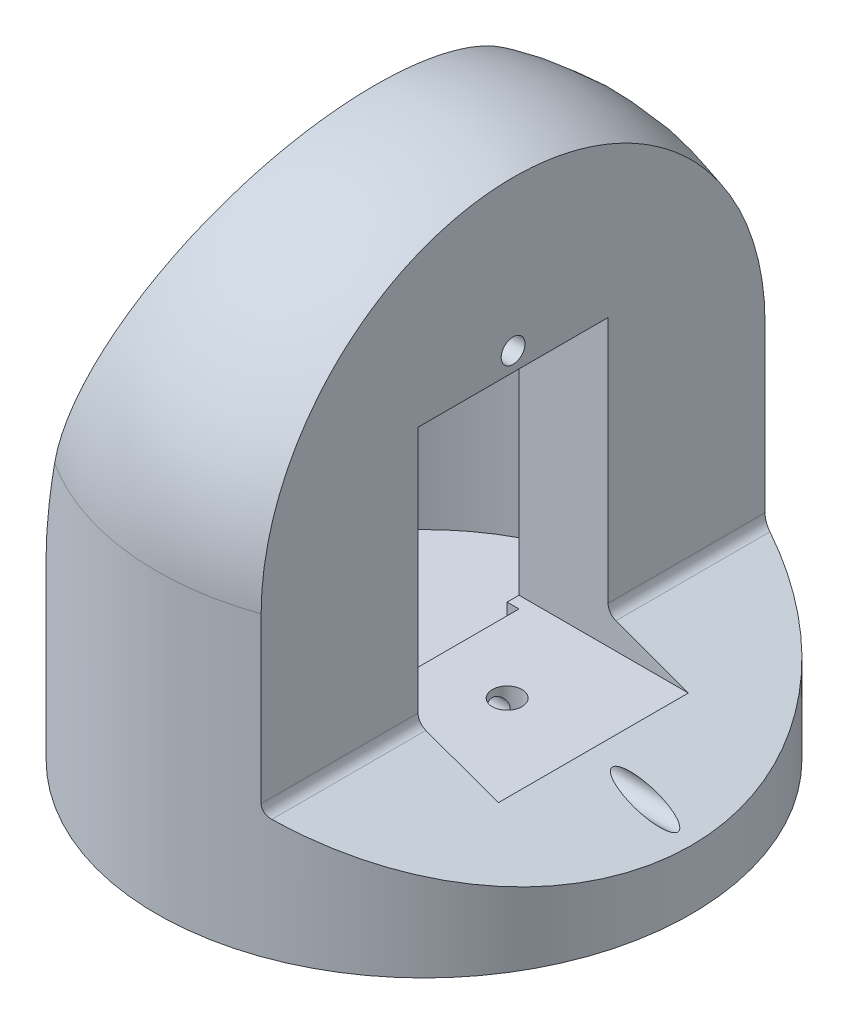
ISO-10303-21;
HEADER;
FILE_DESCRIPTION(('STEP AP214'),'2;1');
FILE_NAME('part.step','',(''),(''),'','','');
FILE_SCHEMA(('AUTOMOTIVE_DESIGN { 1 0 10303 214 1 1 1 1 }'));
ENDSEC;
DATA;
#1=APPLICATION_CONTEXT('core data for automotive mechanical design processes');
#2=APPLICATION_PROTOCOL_DEFINITION('international standard','automotive_design',2000,#1);
#3=PRODUCT_CONTEXT('',#1,'mechanical');
#4=PRODUCT('Part','Part','',(#3));
#5=PRODUCT_RELATED_PRODUCT_CATEGORY('part','',(#4));
#6=PRODUCT_DEFINITION_FORMATION('','',#4);
#7=PRODUCT_DEFINITION_CONTEXT('part definition',#1,'design');
#8=PRODUCT_DEFINITION('design','',#6,#7);
#9=PRODUCT_DEFINITION_SHAPE('','',#8);
#10=(LENGTH_UNIT() NAMED_UNIT(*) SI_UNIT(.MILLI.,.METRE.));
#11=(NAMED_UNIT(*) PLANE_ANGLE_UNIT() SI_UNIT($,.RADIAN.));
#12=(NAMED_UNIT(*) SI_UNIT($,.STERADIAN.) SOLID_ANGLE_UNIT());
#13=UNCERTAINTY_MEASURE_WITH_UNIT(LENGTH_MEASURE(1.E-05),#10,'distance_accuracy_value','');
#14=(GEOMETRIC_REPRESENTATION_CONTEXT(3) GLOBAL_UNCERTAINTY_ASSIGNED_CONTEXT((#13)) GLOBAL_UNIT_ASSIGNED_CONTEXT((#10,
#11,#12)) REPRESENTATION_CONTEXT('',''));
#15=CARTESIAN_POINT('',(0.,0.,0.));
#16=DIRECTION('',(0.,0.,1.));
#17=DIRECTION('',(1.,0.,0.));
#18=AXIS2_PLACEMENT_3D('',#15,#16,#17);
#19=CARTESIAN_POINT('',(0.,25.,0.));
#20=DIRECTION('',(-1.,0.,0.));
#21=DIRECTION('',(0.,0.,1.));
#22=AXIS2_PLACEMENT_3D('',#19,#20,#21);
#23=PLANE('',#22);
#24=DIRECTION('',(0.,0.,1.));
#25=VECTOR('',#24,1.);
#26=CARTESIAN_POINT('',(0.,37.,0.));
#27=LINE('',#26,#25);
#28=CARTESIAN_POINT('',(0.,37.,-6.99999999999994));
#29=VERTEX_POINT('',#28);
#30=CARTESIAN_POINT('',(0.,37.,6.99999999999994));
#31=VERTEX_POINT('',#30);
#32=EDGE_CURVE('E233',#29,#31,#27,.T.);
#33=ORIENTED_EDGE('',*,*,#32,.T.);
#34=DIRECTION('',(0.,-1.,0.));
#35=VECTOR('',#34,1.);
#36=CARTESIAN_POINT('',(0.,0.,6.99999999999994));
#37=LINE('',#36,#35);
#38=CARTESIAN_POINT('',(0.,32.,6.99999999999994));
#39=VERTEX_POINT('',#38);
#40=EDGE_CURVE('E223',#31,#39,#37,.T.);
#41=ORIENTED_EDGE('',*,*,#40,.T.);
#42=DIRECTION('',(0.,0.,1.));
#43=VECTOR('',#42,1.);
#44=CARTESIAN_POINT('',(0.,32.,0.));
#45=LINE('',#44,#43);
#46=CARTESIAN_POINT('',(0.,32.,8.00000000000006));
#47=VERTEX_POINT('',#46);
#48=EDGE_CURVE('E280',#39,#47,#45,.T.);
#49=ORIENTED_EDGE('',*,*,#48,.T.);
#50=DIRECTION('',(0.,1.,0.));
#51=VECTOR('',#50,1.);
#52=CARTESIAN_POINT('',(0.,0.,8.00000000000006));
#53=LINE('',#52,#51);
#54=CARTESIAN_POINT('',(0.,8.00000000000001,8.00000000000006));
#55=VERTEX_POINT('',#54);
#56=EDGE_CURVE('E277',#55,#47,#53,.T.);
#57=ORIENTED_EDGE('',*,*,#56,.F.);
#58=DIRECTION('',(0.,0.,1.));
#59=VECTOR('',#58,1.);
#60=CARTESIAN_POINT('',(0.,7.99999999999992,0.));
#61=LINE('',#60,#59);
#62=CARTESIAN_POINT('',(0.,8.,7.00000000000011));
#63=VERTEX_POINT('',#62);
#64=EDGE_CURVE('E246',#63,#55,#61,.T.);
#65=ORIENTED_EDGE('',*,*,#64,.F.);
#66=DIRECTION('',(0.,1.,0.));
#67=VECTOR('',#66,1.);
#68=CARTESIAN_POINT('',(0.,0.,7.00000000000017));
#69=LINE('',#68,#67);
#70=CARTESIAN_POINT('',(0.,3.,7.00000000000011));
#71=VERTEX_POINT('',#70);
#72=EDGE_CURVE('E255',#71,#63,#69,.T.);
#73=ORIENTED_EDGE('',*,*,#72,.F.);
#74=DIRECTION('',(0.,0.,1.));
#75=VECTOR('',#74,1.);
#76=CARTESIAN_POINT('',(0.,3.,-19.5));
#77=LINE('',#76,#75);
#78=CARTESIAN_POINT('',(0.,3.,19.5));
#79=VERTEX_POINT('',#78);
#80=EDGE_CURVE('E328',#71,#79,#77,.T.);
#81=ORIENTED_EDGE('',*,*,#80,.T.);
#82=DIRECTION('',(0.,-1.,0.));
#83=VECTOR('',#82,1.);
#84=CARTESIAN_POINT('',(0.,25.,19.5));
#85=LINE('',#84,#83);
#86=CARTESIAN_POINT('',(0.,25.,19.5));
#87=VERTEX_POINT('',#86);
#88=EDGE_CURVE('E319',#87,#79,#85,.T.);
#89=ORIENTED_EDGE('',*,*,#88,.F.);
#90=CARTESIAN_POINT('',(0.,25.,0.));
#91=DIRECTION('',(-1.,0.,0.));
#92=DIRECTION('',(0.,0.,1.));
#93=AXIS2_PLACEMENT_3D('',#90,#91,#92);
#94=CIRCLE('',#93,19.5);
#95=CARTESIAN_POINT('',(0.,25.,-19.5));
#96=VERTEX_POINT('',#95);
#97=EDGE_CURVE('E322',#87,#96,#94,.T.);
#98=ORIENTED_EDGE('',*,*,#97,.T.);
#99=DIRECTION('',(0.,-1.,0.));
#100=VECTOR('',#99,1.);
#101=CARTESIAN_POINT('',(0.,25.,-19.5));
#102=LINE('',#101,#100);
#103=CARTESIAN_POINT('',(0.,3.,-19.5));
#104=VERTEX_POINT('',#103);
#105=EDGE_CURVE('E325',#96,#104,#102,.T.);
#106=ORIENTED_EDGE('',*,*,#105,.T.);
#107=CARTESIAN_POINT('',(0.,3.,-6.99999999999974));
#108=VERTEX_POINT('',#107);
#109=EDGE_CURVE('E329',#104,#108,#77,.T.);
#110=ORIENTED_EDGE('',*,*,#109,.T.);
#111=DIRECTION('',(0.,-1.,0.));
#112=VECTOR('',#111,1.);
#113=CARTESIAN_POINT('',(0.,0.,-6.9999999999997));
#114=LINE('',#113,#112);
#115=CARTESIAN_POINT('',(0.,7.99999999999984,-6.99999999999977));
#116=VERTEX_POINT('',#115);
#117=EDGE_CURVE('E262',#116,#108,#114,.T.);
#118=ORIENTED_EDGE('',*,*,#117,.F.);
#119=CARTESIAN_POINT('',(0.,7.99999999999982,-7.99999999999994));
#120=VERTEX_POINT('',#119);
#121=EDGE_CURVE('E274',#120,#116,#61,.T.);
#122=ORIENTED_EDGE('',*,*,#121,.F.);
#123=DIRECTION('',(0.,1.,0.));
#124=VECTOR('',#123,1.);
#125=CARTESIAN_POINT('',(0.,0.,-7.99999999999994));
#126=LINE('',#125,#124);
#127=CARTESIAN_POINT('',(0.,32.,-7.99999999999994));
#128=VERTEX_POINT('',#127);
#129=EDGE_CURVE('E284',#120,#128,#126,.T.);
#130=ORIENTED_EDGE('',*,*,#129,.T.);
#131=CARTESIAN_POINT('',(0.,32.,-6.99999999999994));
#132=VERTEX_POINT('',#131);
#133=EDGE_CURVE('E281',#128,#132,#45,.T.);
#134=ORIENTED_EDGE('',*,*,#133,.T.);
#135=DIRECTION('',(0.,1.,0.));
#136=VECTOR('',#135,1.);
#137=CARTESIAN_POINT('',(0.,0.,-6.99999999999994));
#138=LINE('',#137,#136);
#139=EDGE_CURVE('E230',#132,#29,#138,.T.);
#140=ORIENTED_EDGE('',*,*,#139,.T.);
#141=EDGE_LOOP('',(#33,#41,#49,#57,#65,#73,#81,#89,#98,#106,#110,#118,#122,#130,#134,#140));
#142=FACE_BOUND('',#141,.T.);
#143=ADVANCED_FACE('F50',(#142),#23,.T.);
#144=CARTESIAN_POINT('',(22.5000000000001,32.,0.));
#145=DIRECTION('',(0.,-1.,0.));
#146=DIRECTION('',(1.,0.,0.));
#147=AXIS2_PLACEMENT_3D('',#144,#145,#146);
#148=PLANE('',#147);
#149=ORIENTED_EDGE('',*,*,#48,.F.);
#150=DIRECTION('',(-1.,0.,0.));
#151=VECTOR('',#150,1.);
#152=CARTESIAN_POINT('',(0.999999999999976,32.,6.99999999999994));
#153=LINE('',#152,#151);
#154=CARTESIAN_POINT('',(0.999999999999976,32.,6.99999999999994));
#155=VERTEX_POINT('',#154);
#156=EDGE_CURVE('E244',#155,#39,#153,.T.);
#157=ORIENTED_EDGE('',*,*,#156,.F.);
#158=DIRECTION('',(0.,0.,1.));
#159=VECTOR('',#158,1.);
#160=CARTESIAN_POINT('',(1.,32.,0.));
#161=LINE('',#160,#159);
#162=CARTESIAN_POINT('',(1.00000000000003,32.,-6.99999999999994));
#163=VERTEX_POINT('',#162);
#164=EDGE_CURVE('E225',#163,#155,#161,.T.);
#165=ORIENTED_EDGE('',*,*,#164,.F.);
#166=DIRECTION('',(-1.,0.,0.));
#167=VECTOR('',#166,1.);
#168=CARTESIAN_POINT('',(1.00000000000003,32.,-6.99999999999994));
#169=LINE('',#168,#167);
#170=EDGE_CURVE('E247',#163,#132,#169,.T.);
#171=ORIENTED_EDGE('',*,*,#170,.T.);
#172=ORIENTED_EDGE('',*,*,#133,.F.);
#173=DIRECTION('',(-1.,0.,0.));
#174=VECTOR('',#173,1.);
#175=CARTESIAN_POINT('',(22.5000000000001,32.,-7.99999999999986));
#176=LINE('',#175,#174);
#177=CARTESIAN_POINT('',(7.5,32.,-7.99999999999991));
#178=VERTEX_POINT('',#177);
#179=EDGE_CURVE('E291',#178,#128,#176,.T.);
#180=ORIENTED_EDGE('',*,*,#179,.F.);
#181=DIRECTION('',(0.,0.,-1.));
#182=VECTOR('',#181,1.);
#183=CARTESIAN_POINT('',(7.5,32.,0.));
#184=LINE('',#183,#182);
#185=CARTESIAN_POINT('',(7.5,32.,8.00000000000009));
#186=VERTEX_POINT('',#185);
#187=EDGE_CURVE('E307',#186,#178,#184,.T.);
#188=ORIENTED_EDGE('',*,*,#187,.F.);
#189=DIRECTION('',(-1.,0.,0.));
#190=VECTOR('',#189,1.);
#191=CARTESIAN_POINT('',(22.5,32.,8.00000000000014));
#192=LINE('',#191,#190);
#193=EDGE_CURVE('E293',#186,#47,#192,.T.);
#194=ORIENTED_EDGE('',*,*,#193,.T.);
#195=EDGE_LOOP('',(#149,#157,#165,#171,#172,#180,#188,#194));
#196=FACE_BOUND('',#195,.T.);
#197=ADVANCED_FACE('F403',(#196),#148,.T.);
#198=CARTESIAN_POINT('',(7.5,0.,0.));
#199=DIRECTION('',(1.,0.,0.));
#200=DIRECTION('',(0.,0.,-1.));
#201=AXIS2_PLACEMENT_3D('',#198,#199,#200);
#202=PLANE('',#201);
#203=CARTESIAN_POINT('',(7.5,33.5857864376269,0.));
#204=DIRECTION('',(1.,0.,0.));
#205=DIRECTION('',(0.,0.,-1.));
#206=AXIS2_PLACEMENT_3D('',#203,#204,#205);
#207=CIRCLE('',#206,1.);
#208=CARTESIAN_POINT('',(7.5,33.5857864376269,-0.999999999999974));
#209=VERTEX_POINT('',#208);
#210=EDGE_CURVE('E512',#209,#209,#207,.T.);
#211=ORIENTED_EDGE('',*,*,#210,.F.);
#212=EDGE_LOOP('',(#211));
#213=FACE_BOUND('',#212,.T.);
#214=ORIENTED_EDGE('',*,*,#187,.T.);
#215=DIRECTION('',(0.,-1.,0.));
#216=VECTOR('',#215,1.);
#217=CARTESIAN_POINT('',(7.5,0.,-7.99999999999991));
#218=LINE('',#217,#216);
#219=CARTESIAN_POINT('',(7.5,11.1597610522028,-7.99999999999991));
#220=VERTEX_POINT('',#219);
#221=EDGE_CURVE('E304',#178,#220,#218,.T.);
#222=ORIENTED_EDGE('',*,*,#221,.T.);
#223=DIRECTION('',(0.,0.,-1.));
#224=VECTOR('',#223,1.);
#225=CARTESIAN_POINT('',(7.5,11.1597610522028,0.));
#226=LINE('',#225,#224);
#227=CARTESIAN_POINT('',(7.5,11.1597610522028,-21.2132034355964));
#228=VERTEX_POINT('',#227);
#229=EDGE_CURVE('E360',#220,#228,#226,.T.);
#230=ORIENTED_EDGE('',*,*,#229,.T.);
#231=DIRECTION('',(0.,-1.,0.));
#232=VECTOR('',#231,1.);
#233=CARTESIAN_POINT('',(7.5,0.,-21.2132034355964));
#234=LINE('',#233,#232);
#235=CARTESIAN_POINT('',(7.5,25.,-21.2132034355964));
#236=VERTEX_POINT('',#235);
#237=EDGE_CURVE('E339',#228,#236,#234,.F.);
#238=ORIENTED_EDGE('',*,*,#237,.T.);
#239=CARTESIAN_POINT('',(7.5,25.,0.));
#240=DIRECTION('',(1.,0.,0.));
#241=DIRECTION('',(0.,0.,-1.));
#242=AXIS2_PLACEMENT_3D('',#239,#240,#241);
#243=CIRCLE('',#242,21.2132034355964);
#244=CARTESIAN_POINT('',(7.5,25.,21.2132034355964));
#245=VERTEX_POINT('',#244);
#246=EDGE_CURVE('E351',#236,#245,#243,.T.);
#247=ORIENTED_EDGE('',*,*,#246,.T.);
#248=DIRECTION('',(0.,-1.,0.));
#249=VECTOR('',#248,1.);
#250=CARTESIAN_POINT('',(7.5,0.,21.2132034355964));
#251=LINE('',#250,#249);
#252=CARTESIAN_POINT('',(7.5,11.1597610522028,21.2132034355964));
#253=VERTEX_POINT('',#252);
#254=EDGE_CURVE('E341',#245,#253,#251,.T.);
#255=ORIENTED_EDGE('',*,*,#254,.T.);
#256=CARTESIAN_POINT('',(7.5,11.1597610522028,8.0000000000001));
#257=VERTEX_POINT('',#256);
#258=EDGE_CURVE('E361',#253,#257,#226,.T.);
#259=ORIENTED_EDGE('',*,*,#258,.T.);
#260=DIRECTION('',(0.,-1.,0.));
#261=VECTOR('',#260,1.);
#262=CARTESIAN_POINT('',(7.5,0.,8.00000000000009));
#263=LINE('',#262,#261);
#264=EDGE_CURVE('E300',#186,#257,#263,.T.);
#265=ORIENTED_EDGE('',*,*,#264,.F.);
#266=EDGE_LOOP('',(#214,#222,#230,#238,#247,#255,#259,#265));
#267=FACE_BOUND('',#266,.T.);
#268=ADVANCED_FACE('F395',(#213,#267),#202,.T.);
#269=CARTESIAN_POINT('',(7.5,10.459553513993,0.));
#270=DIRECTION('',(-0.342020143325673,-0.939692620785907,0.));
#271=DIRECTION('',(0.,0.,-1.));
#272=AXIS2_PLACEMENT_3D('',#269,#270,#271);
#273=PLANE('',#272);
#274=CARTESIAN_POINT('',(18.6144801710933,6.41421356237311,0.));
#275=DIRECTION('',(-0.342020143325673,-0.939692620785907,0.));
#276=DIRECTION('',(-0.939692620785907,0.342020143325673,0.));
#277=AXIS2_PLACEMENT_3D('',#274,#275,#276);
#278=ELLIPSE('',#277,2.92380440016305,1.);
#279=CARTESIAN_POINT('',(15.8670027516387,7.41421356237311,0.));
#280=VERTEX_POINT('',#279);
#281=EDGE_CURVE('E581',#280,#280,#278,.T.);
#282=ORIENTED_EDGE('',*,*,#281,.T.);
#283=EDGE_LOOP('',(#282));
#284=FACE_BOUND('',#283,.T.);
#285=DIRECTION('',(-0.939692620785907,0.342020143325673,0.));
#286=VECTOR('',#285,1.);
#287=CARTESIAN_POINT('',(7.50000000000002,10.459553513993,-7.99999999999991));
#288=LINE('',#287,#286);
#289=CARTESIAN_POINT('',(14.2575677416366,7.99999999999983,-7.99999999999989));
#290=VERTEX_POINT('',#289);
#291=CARTESIAN_POINT('',(8.15797985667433,10.2200684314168,-7.99999999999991));
#292=VERTEX_POINT('',#291);
#293=EDGE_CURVE('E302',#290,#292,#288,.T.);
#294=ORIENTED_EDGE('',*,*,#293,.F.);
#295=DIRECTION('',(0.,0.,1.));
#296=VECTOR('',#295,1.);
#297=CARTESIAN_POINT('',(14.2575677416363,7.99999999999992,2.50758616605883E-13));
#298=LINE('',#297,#296);
#299=CARTESIAN_POINT('',(14.257567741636,8.00000000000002,8.00000000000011));
#300=VERTEX_POINT('',#299);
#301=EDGE_CURVE('E13',#290,#300,#298,.T.);
#302=ORIENTED_EDGE('',*,*,#301,.T.);
#303=DIRECTION('',(-0.939692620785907,0.342020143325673,0.));
#304=VECTOR('',#303,1.);
#305=CARTESIAN_POINT('',(7.49999999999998,10.4595535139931,8.00000000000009));
#306=LINE('',#305,#304);
#307=CARTESIAN_POINT('',(8.15797985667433,10.2200684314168,8.00000000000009));
#308=VERTEX_POINT('',#307);
#309=EDGE_CURVE('E290',#300,#308,#306,.T.);
#310=ORIENTED_EDGE('',*,*,#309,.T.);
#311=DIRECTION('',(0.,0.,-1.));
#312=VECTOR('',#311,1.);
#313=CARTESIAN_POINT('',(8.15797985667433,10.2200684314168,0.));
#314=LINE('',#313,#312);
#315=CARTESIAN_POINT('',(8.15797985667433,10.2200684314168,20.9689619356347));
#316=VERTEX_POINT('',#315);
#317=EDGE_CURVE('E364',#308,#316,#314,.F.);
#318=ORIENTED_EDGE('',*,*,#317,.T.);
#319=CARTESIAN_POINT('',(0.,13.1893302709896,0.));
#320=DIRECTION('',(-0.342020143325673,-0.939692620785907,0.));
#321=DIRECTION('',(0.939692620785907,-0.342020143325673,0.));
#322=AXIS2_PLACEMENT_3D('',#319,#320,#321);
#323=ELLIPSE('',#322,23.9439998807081,22.5);
#324=CARTESIAN_POINT('',(22.4999999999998,5.,0.));
#325=VERTEX_POINT('',#324);
#326=EDGE_CURVE('E357',#325,#316,#323,.T.);
#327=ORIENTED_EDGE('',*,*,#326,.F.);
#328=CARTESIAN_POINT('',(0.,13.1893302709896,0.));
#329=DIRECTION('',(-0.342020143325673,-0.939692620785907,0.));
#330=DIRECTION('',(0.939692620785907,-0.342020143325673,0.));
#331=AXIS2_PLACEMENT_3D('',#328,#329,#330);
#332=ELLIPSE('',#331,23.9439998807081,22.5);
#333=CARTESIAN_POINT('',(8.15797985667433,10.2200684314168,-20.9689619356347));
#334=VERTEX_POINT('',#333);
#335=EDGE_CURVE('E355',#334,#325,#332,.T.);
#336=ORIENTED_EDGE('',*,*,#335,.F.);
#337=EDGE_CURVE('E365',#334,#292,#314,.F.);
#338=ORIENTED_EDGE('',*,*,#337,.T.);
#339=EDGE_LOOP('',(#294,#302,#310,#318,#327,#336,#338));
#340=FACE_BOUND('',#339,.T.);
#341=ADVANCED_FACE('F393',(#284,#340),#273,.F.);
#342=CARTESIAN_POINT('',(8.5,11.1597610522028,0.));
#343=DIRECTION('',(0.,0.,-1.));
#344=DIRECTION('',(-1.,0.,0.));
#345=AXIS2_PLACEMENT_3D('',#342,#343,#344);
#346=CYLINDRICAL_SURFACE('',#345,1.);
#347=CARTESIAN_POINT('',(8.5,11.1597610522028,-7.99999999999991));
#348=DIRECTION('',(0.,0.,1.));
#349=DIRECTION('',(1.,0.,0.));
#350=AXIS2_PLACEMENT_3D('',#347,#348,#349);
#351=CIRCLE('',#350,1.);
#352=EDGE_CURVE('E64',#292,#220,#351,.F.);
#353=ORIENTED_EDGE('',*,*,#352,.F.);
#354=ORIENTED_EDGE('',*,*,#337,.F.);
#355=CARTESIAN_POINT('',(7.5,11.1597610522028,-21.2132034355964));
#356=CARTESIAN_POINT('',(7.49999940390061,11.1328393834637,-21.2132033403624));
#357=CARTESIAN_POINT('',(7.50108791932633,11.1059309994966,-21.2128188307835));
#358=CARTESIAN_POINT('',(7.5054251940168,11.0523148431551,-21.2112847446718));
#359=CARTESIAN_POINT('',(7.50867363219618,11.0256070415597,-21.210135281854));
#360=CARTESIAN_POINT('',(7.52160818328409,10.9461819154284,-21.2055534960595));
#361=CARTESIAN_POINT('',(7.53448376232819,10.8940103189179,-21.2009877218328));
#362=CARTESIAN_POINT('',(7.56825893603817,10.79272846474,-21.1889540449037));
#363=CARTESIAN_POINT('',(7.58915820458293,10.7436180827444,-21.1814862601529));
#364=CARTESIAN_POINT('',(7.63822670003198,10.6497098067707,-21.1638410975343));
#365=CARTESIAN_POINT('',(7.66639598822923,10.6049119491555,-21.153663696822));
#366=CARTESIAN_POINT('',(7.72973345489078,10.5197877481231,-21.1306028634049));
#367=CARTESIAN_POINT('',(7.76504011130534,10.4795793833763,-21.1176655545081));
#368=CARTESIAN_POINT('',(7.84113760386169,10.4056277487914,-21.0895283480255));
#369=CARTESIAN_POINT('',(7.88193179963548,10.3718884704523,-21.0743270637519));
#370=CARTESIAN_POINT('',(7.96117839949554,10.316170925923,-21.0445037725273));
#371=CARTESIAN_POINT('',(7.99902945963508,10.2931823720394,-21.0301508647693));
#372=CARTESIAN_POINT('',(8.07697892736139,10.2525755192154,-21.0003375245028));
#373=CARTESIAN_POINT('',(8.11707185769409,10.2349447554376,-20.9848797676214));
#374=CARTESIAN_POINT('',(8.15797985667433,10.2200684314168,-20.9689619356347));
#375=B_SPLINE_CURVE_WITH_KNOTS('',3,(#355,#356,#357,#358,#359,#360,#361,#362,#363,#364,#365,
#366,#367,#368,#369,#370,#371,#372,#373,#374),.UNSPECIFIED.,.F.,.F.,(4,2,2,2,2,2,2,2,2,4),(0.,
0.0807140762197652,0.161416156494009,0.322368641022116,0.483314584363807,0.644261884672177,
0.808698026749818,0.973235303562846,1.11252247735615,1.25148307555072),.UNSPECIFIED.);
#376=EDGE_CURVE('E368',#228,#334,#375,.T.);
#377=ORIENTED_EDGE('',*,*,#376,.F.);
#378=ORIENTED_EDGE('',*,*,#229,.F.);
#379=EDGE_LOOP('',(#353,#354,#377,#378));
#380=FACE_BOUND('',#379,.T.);
#381=ADVANCED_FACE('F385',(#380),#346,.F.);
#382=CARTESIAN_POINT('',(0.,0.,0.));
#383=DIRECTION('',(0.,-1.,0.));
#384=DIRECTION('',(0.,0.,-1.));
#385=AXIS2_PLACEMENT_3D('',#382,#383,#384);
#386=CYLINDRICAL_SURFACE('',#385,22.5);
#387=CARTESIAN_POINT('',(0.,58.4760880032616,0.));
#388=DIRECTION('',(-0.939692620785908,0.342020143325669,0.));
#389=DIRECTION('',(-0.342020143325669,-0.939692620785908,0.));
#390=AXIS2_PLACEMENT_3D('',#387,#388,#389);
#391=ELLIPSE('',#390,65.7855990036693,22.5);
#392=CARTESIAN_POINT('',(-21.2835554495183,0.,7.29796323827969));
#393=VERTEX_POINT('',#392);
#394=CARTESIAN_POINT('',(-12.1842995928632,25.,18.9154128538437));
#395=VERTEX_POINT('',#394);
#396=EDGE_CURVE('E316',#393,#395,#391,.T.);
#397=ORIENTED_EDGE('',*,*,#396,.F.);
#398=CARTESIAN_POINT('',(0.,0.,0.));
#399=DIRECTION('',(0.,-1.,0.));
#400=DIRECTION('',(0.,0.,-1.));
#401=AXIS2_PLACEMENT_3D('',#398,#399,#400);
#402=CIRCLE('',#401,22.5);
#403=CARTESIAN_POINT('',(-21.2835554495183,0.,-7.29796323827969));
#404=VERTEX_POINT('',#403);
#405=EDGE_CURVE('E348',#404,#393,#402,.T.);
#406=ORIENTED_EDGE('',*,*,#405,.F.);
#407=CARTESIAN_POINT('',(-12.1842995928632,25.,-18.9154128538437));
#408=VERTEX_POINT('',#407);
#409=EDGE_CURVE('E314',#408,#404,#391,.T.);
#410=ORIENTED_EDGE('',*,*,#409,.F.);
#411=CARTESIAN_POINT('',(0.,25.,0.));
#412=DIRECTION('',(0.,-1.,0.));
#413=DIRECTION('',(0.,0.,-1.));
#414=AXIS2_PLACEMENT_3D('',#411,#412,#413);
#415=CIRCLE('',#414,22.5);
#416=EDGE_CURVE('E344',#408,#236,#415,.T.);
#417=ORIENTED_EDGE('',*,*,#416,.T.);
#418=ORIENTED_EDGE('',*,*,#237,.F.);
#419=ORIENTED_EDGE('',*,*,#376,.T.);
#420=ORIENTED_EDGE('',*,*,#335,.T.);
#421=ORIENTED_EDGE('',*,*,#326,.T.);
#422=CARTESIAN_POINT('',(8.15797985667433,10.2200684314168,20.9689619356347));
#423=CARTESIAN_POINT('',(8.10509601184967,10.2392684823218,20.9895435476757));
#424=CARTESIAN_POINT('',(8.05355719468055,10.2631278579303,21.0093572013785));
#425=CARTESIAN_POINT('',(7.95461058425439,10.3196534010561,21.0470164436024));
#426=CARTESIAN_POINT('',(7.90721207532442,10.3523387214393,21.0648576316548));
#427=CARTESIAN_POINT('',(7.81814371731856,10.4259883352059,21.0980785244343));
#428=CARTESIAN_POINT('',(7.7764854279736,10.4669689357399,21.1134532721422));
#429=CARTESIAN_POINT('',(7.7006023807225,10.5561201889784,21.1412476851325));
#430=CARTESIAN_POINT('',(7.66636942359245,10.6042828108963,21.153670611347));
#431=CARTESIAN_POINT('',(7.60815662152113,10.7039293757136,21.1746751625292));
#432=CARTESIAN_POINT('',(7.58375603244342,10.7551343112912,21.1834153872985));
#433=CARTESIAN_POINT('',(7.54388922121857,10.8613318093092,21.197645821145));
#434=CARTESIAN_POINT('',(7.52841579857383,10.9163212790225,21.2031386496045));
#435=CARTESIAN_POINT('',(7.51183793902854,11.0031496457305,21.2090152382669));
#436=CARTESIAN_POINT('',(7.5074015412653,11.034311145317,21.2105855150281));
#437=CARTESIAN_POINT('',(7.50148377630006,11.0968965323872,21.2126788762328));
#438=CARTESIAN_POINT('',(7.49999757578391,11.1283199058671,21.2132036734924));
#439=CARTESIAN_POINT('',(7.5,11.1597610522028,21.2132034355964));
#440=B_SPLINE_CURVE_WITH_KNOTS('',3,(#422,#423,#424,#425,#426,#427,#428,#429,#430,#431,#432,
#433,#434,#435,#436,#437,#438,#439),.UNSPECIFIED.,.F.,.F.,(4,2,2,2,2,2,2,2,4),(0.,
0.179596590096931,0.359586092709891,0.539932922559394,0.720079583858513,0.89138508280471,
1.06255221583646,1.15695629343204,1.25120558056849),.UNSPECIFIED.);
#441=EDGE_CURVE('E374',#316,#253,#440,.T.);
#442=ORIENTED_EDGE('',*,*,#441,.T.);
#443=ORIENTED_EDGE('',*,*,#254,.F.);
#444=EDGE_CURVE('E345',#245,#395,#415,.T.);
#445=ORIENTED_EDGE('',*,*,#444,.T.);
#446=EDGE_LOOP('',(#397,#406,#410,#417,#418,#419,#420,#421,#442,#443,#445));
#447=FACE_BOUND('',#446,.T.);
#448=ADVANCED_FACE('F379',(#447),#386,.T.);
#449=CARTESIAN_POINT('',(0.,25.,0.));
#450=DIRECTION('',(0.,-1.,0.));
#451=DIRECTION('',(-1.,0.,0.));
#452=AXIS2_PLACEMENT_3D('',#449,#450,#451);
#453=SPHERICAL_SURFACE('',#452,22.5);
#454=CARTESIAN_POINT('',(-10.7590072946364,28.9159584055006,0.));
#455=DIRECTION('',(-0.939692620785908,0.342020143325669,0.));
#456=DIRECTION('',(-0.342020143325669,-0.939692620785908,0.));
#457=AXIS2_PLACEMENT_3D('',#454,#455,#456);
#458=CIRCLE('',#457,19.3690224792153);
#459=EDGE_CURVE('E317',#395,#408,#458,.T.);
#460=ORIENTED_EDGE('',*,*,#459,.F.);
#461=ORIENTED_EDGE('',*,*,#444,.F.);
#462=ORIENTED_EDGE('',*,*,#246,.F.);
#463=ORIENTED_EDGE('',*,*,#416,.F.);
#464=EDGE_LOOP('',(#460,#461,#462,#463));
#465=FACE_BOUND('',#464,.T.);
#466=ADVANCED_FACE('F384',(#465),#453,.T.);
#467=CARTESIAN_POINT('',(-22.5,0.,0.));
#468=DIRECTION('',(0.,1.,0.));
#469=DIRECTION('',(0.,0.,1.));
#470=AXIS2_PLACEMENT_3D('',#467,#468,#469);
#471=PLANE('',#470);
#472=CARTESIAN_POINT('',(0.,0.,0.));
#473=DIRECTION('',(0.,-1.,0.));
#474=DIRECTION('',(0.,0.,-1.));
#475=AXIS2_PLACEMENT_3D('',#472,#473,#474);
#476=CIRCLE('',#475,11.);
#477=CARTESIAN_POINT('',(0.,0.,-11.));
#478=VERTEX_POINT('',#477);
#479=EDGE_CURVE('E236',#478,#478,#476,.T.);
#480=ORIENTED_EDGE('',*,*,#479,.F.);
#481=EDGE_LOOP('',(#480));
#482=FACE_BOUND('',#481,.T.);
#483=DIRECTION('',(0.,0.,1.));
#484=VECTOR('',#483,1.);
#485=CARTESIAN_POINT('',(-21.2835554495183,0.,0.));
#486=LINE('',#485,#484);
#487=EDGE_CURVE('E312',#404,#393,#486,.T.);
#488=ORIENTED_EDGE('',*,*,#487,.F.);
#489=ORIENTED_EDGE('',*,*,#405,.T.);
#490=EDGE_LOOP('',(#488,#489));
#491=FACE_BOUND('',#490,.T.);
#492=ADVANCED_FACE('F388',(#482,#491),#471,.F.);
#493=CARTESIAN_POINT('',(-18.7938524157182,6.84040286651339,0.));
#494=DIRECTION('',(-0.939692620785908,0.342020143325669,0.));
#495=DIRECTION('',(-0.342020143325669,-0.939692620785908,0.));
#496=AXIS2_PLACEMENT_3D('',#493,#494,#495);
#497=PLANE('',#496);
#498=CARTESIAN_POINT('',(-10.7590072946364,28.9159584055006,0.));
#499=DIRECTION('',(-0.939692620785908,0.342020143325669,0.));
#500=DIRECTION('',(-0.342020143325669,-0.939692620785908,0.));
#501=AXIS2_PLACEMENT_3D('',#498,#499,#500);
#502=CIRCLE('',#501,15.7847721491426);
#503=CARTESIAN_POINT('',(-12.1842995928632,25.,-15.2247444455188));
#504=VERTEX_POINT('',#503);
#505=CARTESIAN_POINT('',(-12.1842995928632,25.,15.2247444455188));
#506=VERTEX_POINT('',#505);
#507=EDGE_CURVE('E310',#504,#506,#502,.F.);
#508=ORIENTED_EDGE('',*,*,#507,.T.);
#509=CARTESIAN_POINT('',(0.,58.4760880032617,0.));
#510=DIRECTION('',(-0.939692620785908,0.342020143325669,0.));
#511=DIRECTION('',(0.342020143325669,0.939692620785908,0.));
#512=AXIS2_PLACEMENT_3D('',#509,#510,#511);
#513=ELLIPSE('',#512,57.0141858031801,19.5);
#514=EDGE_CURVE('E353',#506,#504,#513,.F.);
#515=ORIENTED_EDGE('',*,*,#514,.T.);
#516=EDGE_LOOP('',(#508,#515));
#517=FACE_BOUND('',#516,.T.);
#518=ORIENTED_EDGE('',*,*,#459,.T.);
#519=ORIENTED_EDGE('',*,*,#409,.T.);
#520=ORIENTED_EDGE('',*,*,#487,.T.);
#521=ORIENTED_EDGE('',*,*,#396,.T.);
#522=EDGE_LOOP('',(#518,#519,#520,#521));
#523=FACE_BOUND('',#522,.T.);
#524=ADVANCED_FACE('F391',(#517,#523),#497,.T.);
#525=CARTESIAN_POINT('',(0.,25.,0.));
#526=DIRECTION('',(0.,1.,0.));
#527=DIRECTION('',(0.,0.,-1.));
#528=AXIS2_PLACEMENT_3D('',#525,#526,#527);
#529=SPHERICAL_SURFACE('',#528,19.5);
#530=ORIENTED_EDGE('',*,*,#507,.F.);
#531=CARTESIAN_POINT('',(0.,25.,0.));
#532=DIRECTION('',(0.,1.,0.));
#533=DIRECTION('',(-1.,0.,0.));
#534=AXIS2_PLACEMENT_3D('',#531,#532,#533);
#535=CIRCLE('',#534,19.5);
#536=EDGE_CURVE('E336',#96,#504,#535,.T.);
#537=ORIENTED_EDGE('',*,*,#536,.F.);
#538=ORIENTED_EDGE('',*,*,#97,.F.);
#539=EDGE_CURVE('E335',#506,#87,#535,.T.);
#540=ORIENTED_EDGE('',*,*,#539,.F.);
#541=EDGE_LOOP('',(#530,#537,#538,#540));
#542=FACE_BOUND('',#541,.T.);
#543=ADVANCED_FACE('F418',(#542),#529,.F.);
#544=CARTESIAN_POINT('',(0.,44.5,0.));
#545=DIRECTION('',(0.,1.,0.));
#546=DIRECTION('',(-1.,0.,0.));
#547=AXIS2_PLACEMENT_3D('',#544,#545,#546);
#548=CYLINDRICAL_SURFACE('',#547,19.5);
#549=ORIENTED_EDGE('',*,*,#514,.F.);
#550=ORIENTED_EDGE('',*,*,#539,.T.);
#551=ORIENTED_EDGE('',*,*,#88,.T.);
#552=CARTESIAN_POINT('',(0.,3.,0.));
#553=DIRECTION('',(0.,1.,0.));
#554=DIRECTION('',(-1.,0.,0.));
#555=AXIS2_PLACEMENT_3D('',#552,#553,#554);
#556=CIRCLE('',#555,19.5);
#557=EDGE_CURVE('E332',#104,#79,#556,.T.);
#558=ORIENTED_EDGE('',*,*,#557,.F.);
#559=ORIENTED_EDGE('',*,*,#105,.F.);
#560=ORIENTED_EDGE('',*,*,#536,.T.);
#561=EDGE_LOOP('',(#549,#550,#551,#558,#559,#560));
#562=FACE_BOUND('',#561,.T.);
#563=ADVANCED_FACE('F421',(#562),#548,.F.);
#564=CARTESIAN_POINT('',(0.,3.,-19.5));
#565=DIRECTION('',(0.,-1.,0.));
#566=DIRECTION('',(1.,0.,0.));
#567=AXIS2_PLACEMENT_3D('',#564,#565,#566);
#568=PLANE('',#567);
#569=CARTESIAN_POINT('',(-7.,3.,0.));
#570=DIRECTION('',(0.,-1.,0.));
#571=DIRECTION('',(1.,0.,0.));
#572=AXIS2_PLACEMENT_3D('',#569,#570,#571);
#573=CIRCLE('',#572,1.24999999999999);
#574=CARTESIAN_POINT('',(-5.75000000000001,3.,0.));
#575=VERTEX_POINT('',#574);
#576=EDGE_CURVE('E509',#575,#575,#573,.T.);
#577=ORIENTED_EDGE('',*,*,#576,.T.);
#578=EDGE_LOOP('',(#577));
#579=FACE_BOUND('',#578,.T.);
#580=ORIENTED_EDGE('',*,*,#109,.F.);
#581=ORIENTED_EDGE('',*,*,#557,.T.);
#582=ORIENTED_EDGE('',*,*,#80,.F.);
#583=DIRECTION('',(-1.,0.,0.));
#584=VECTOR('',#583,1.);
#585=CARTESIAN_POINT('',(0.999999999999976,3.,7.00000000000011));
#586=LINE('',#585,#584);
#587=CARTESIAN_POINT('',(0.999999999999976,3.,7.00000000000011));
#588=VERTEX_POINT('',#587);
#589=EDGE_CURVE('E269',#588,#71,#586,.T.);
#590=ORIENTED_EDGE('',*,*,#589,.F.);
#591=DIRECTION('',(0.,0.,1.));
#592=VECTOR('',#591,1.);
#593=CARTESIAN_POINT('',(1.,3.,0.));
#594=LINE('',#593,#592);
#595=CARTESIAN_POINT('',(1.00000000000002,3.,-6.99999999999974));
#596=VERTEX_POINT('',#595);
#597=EDGE_CURVE('E258',#596,#588,#594,.T.);
#598=ORIENTED_EDGE('',*,*,#597,.F.);
#599=DIRECTION('',(-1.,0.,0.));
#600=VECTOR('',#599,1.);
#601=CARTESIAN_POINT('',(1.00000000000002,3.,-6.99999999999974));
#602=LINE('',#601,#600);
#603=EDGE_CURVE('E271',#596,#108,#602,.T.);
#604=ORIENTED_EDGE('',*,*,#603,.T.);
#605=EDGE_LOOP('',(#580,#581,#582,#590,#598,#604));
#606=FACE_BOUND('',#605,.T.);
#607=ADVANCED_FACE('F423',(#579,#606),#568,.F.);
#608=ORIENTED_EDGE('',*,*,#317,.F.);
#609=CARTESIAN_POINT('',(8.5,11.1597610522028,8.00000000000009));
#610=DIRECTION('',(0.,0.,1.));
#611=DIRECTION('',(1.,0.,0.));
#612=AXIS2_PLACEMENT_3D('',#609,#610,#611);
#613=CIRCLE('',#612,1.);
#614=EDGE_CURVE('E548',#308,#257,#613,.F.);
#615=ORIENTED_EDGE('',*,*,#614,.T.);
#616=ORIENTED_EDGE('',*,*,#258,.F.);
#617=ORIENTED_EDGE('',*,*,#441,.F.);
#618=EDGE_LOOP('',(#608,#615,#616,#617));
#619=FACE_BOUND('',#618,.T.);
#620=ADVANCED_FACE('F52',(#619),#346,.F.);
#621=CARTESIAN_POINT('',(22.5000000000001,7.99999999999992,0.));
#622=DIRECTION('',(0.,-1.,0.));
#623=DIRECTION('',(0.,0.,-1.));
#624=AXIS2_PLACEMENT_3D('',#621,#622,#623);
#625=PLANE('',#624);
#626=CARTESIAN_POINT('',(7.,7.99999999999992,0.));
#627=DIRECTION('',(0.,-1.,0.));
#628=DIRECTION('',(0.,0.,-1.));
#629=AXIS2_PLACEMENT_3D('',#626,#627,#628);
#630=CIRCLE('',#629,1.24999999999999);
#631=CARTESIAN_POINT('',(7.,7.9999999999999,-1.24999999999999));
#632=VERTEX_POINT('',#631);
#633=EDGE_CURVE('E503',#632,#632,#630,.T.);
#634=ORIENTED_EDGE('',*,*,#633,.T.);
#635=EDGE_LOOP('',(#634));
#636=FACE_BOUND('',#635,.T.);
#637=DIRECTION('',(0.,0.,1.));
#638=VECTOR('',#637,1.);
#639=CARTESIAN_POINT('',(1.,7.99999999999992,0.));
#640=LINE('',#639,#638);
#641=CARTESIAN_POINT('',(1.00000000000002,7.99999999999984,-6.99999999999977));
#642=VERTEX_POINT('',#641);
#643=CARTESIAN_POINT('',(0.999999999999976,8.,7.00000000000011));
#644=VERTEX_POINT('',#643);
#645=EDGE_CURVE('E251',#642,#644,#640,.T.);
#646=ORIENTED_EDGE('',*,*,#645,.T.);
#647=DIRECTION('',(-1.,0.,0.));
#648=VECTOR('',#647,1.);
#649=CARTESIAN_POINT('',(0.999999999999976,8.,7.00000000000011));
#650=LINE('',#649,#648);
#651=EDGE_CURVE('E242',#644,#63,#650,.T.);
#652=ORIENTED_EDGE('',*,*,#651,.T.);
#653=ORIENTED_EDGE('',*,*,#64,.T.);
#654=DIRECTION('',(-1.,0.,0.));
#655=VECTOR('',#654,1.);
#656=CARTESIAN_POINT('',(22.5,8.00000000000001,8.00000000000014));
#657=LINE('',#656,#655);
#658=EDGE_CURVE('E287',#300,#55,#657,.T.);
#659=ORIENTED_EDGE('',*,*,#658,.F.);
#660=ORIENTED_EDGE('',*,*,#301,.F.);
#661=DIRECTION('',(-1.,0.,0.));
#662=VECTOR('',#661,1.);
#663=CARTESIAN_POINT('',(22.5000000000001,7.99999999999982,-7.99999999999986));
#664=LINE('',#663,#662);
#665=EDGE_CURVE('E288',#290,#120,#664,.T.);
#666=ORIENTED_EDGE('',*,*,#665,.T.);
#667=ORIENTED_EDGE('',*,*,#121,.T.);
#668=DIRECTION('',(-1.,0.,0.));
#669=VECTOR('',#668,1.);
#670=CARTESIAN_POINT('',(1.00000000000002,7.99999999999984,-6.99999999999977));
#671=LINE('',#670,#669);
#672=EDGE_CURVE('E261',#642,#116,#671,.T.);
#673=ORIENTED_EDGE('',*,*,#672,.F.);
#674=EDGE_LOOP('',(#646,#652,#653,#659,#660,#666,#667,#673));
#675=FACE_BOUND('',#674,.T.);
#676=ADVANCED_FACE('F451',(#636,#675),#625,.F.);
#677=CARTESIAN_POINT('',(22.5000000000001,0.,-7.99999999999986));
#678=DIRECTION('',(0.,0.,1.));
#679=DIRECTION('',(1.,0.,0.));
#680=AXIS2_PLACEMENT_3D('',#677,#678,#679);
#681=PLANE('',#680);
#682=ORIENTED_EDGE('',*,*,#179,.T.);
#683=ORIENTED_EDGE('',*,*,#129,.F.);
#684=ORIENTED_EDGE('',*,*,#665,.F.);
#685=ORIENTED_EDGE('',*,*,#293,.T.);
#686=ORIENTED_EDGE('',*,*,#352,.T.);
#687=ORIENTED_EDGE('',*,*,#221,.F.);
#688=EDGE_LOOP('',(#682,#683,#684,#685,#686,#687));
#689=FACE_BOUND('',#688,.T.);
#690=ADVANCED_FACE('F457',(#689),#681,.T.);
#691=CARTESIAN_POINT('',(22.5,0.,8.00000000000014));
#692=DIRECTION('',(0.,0.,1.));
#693=DIRECTION('',(1.,0.,0.));
#694=AXIS2_PLACEMENT_3D('',#691,#692,#693);
#695=PLANE('',#694);
#696=ORIENTED_EDGE('',*,*,#264,.T.);
#697=ORIENTED_EDGE('',*,*,#614,.F.);
#698=ORIENTED_EDGE('',*,*,#309,.F.);
#699=ORIENTED_EDGE('',*,*,#658,.T.);
#700=ORIENTED_EDGE('',*,*,#56,.T.);
#701=ORIENTED_EDGE('',*,*,#193,.F.);
#702=EDGE_LOOP('',(#696,#697,#698,#699,#700,#701));
#703=FACE_BOUND('',#702,.T.);
#704=ADVANCED_FACE('F467',(#703),#695,.F.);
#705=CARTESIAN_POINT('',(0.999999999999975,0.,6.99999999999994));
#706=DIRECTION('',(0.,0.,-1.));
#707=DIRECTION('',(-1.,0.,0.));
#708=AXIS2_PLACEMENT_3D('',#705,#706,#707);
#709=PLANE('',#708);
#710=ORIENTED_EDGE('',*,*,#40,.F.);
#711=DIRECTION('',(-1.,0.,0.));
#712=VECTOR('',#711,1.);
#713=CARTESIAN_POINT('',(0.999999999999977,37.,6.99999999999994));
#714=LINE('',#713,#712);
#715=CARTESIAN_POINT('',(0.999999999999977,37.,6.99999999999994));
#716=VERTEX_POINT('',#715);
#717=EDGE_CURVE('E214',#716,#31,#714,.T.);
#718=ORIENTED_EDGE('',*,*,#717,.F.);
#719=DIRECTION('',(0.,-1.,0.));
#720=VECTOR('',#719,1.);
#721=CARTESIAN_POINT('',(0.999999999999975,0.,6.99999999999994));
#722=LINE('',#721,#720);
#723=EDGE_CURVE('E218',#716,#155,#722,.T.);
#724=ORIENTED_EDGE('',*,*,#723,.T.);
#725=ORIENTED_EDGE('',*,*,#156,.T.);
#726=EDGE_LOOP('',(#710,#718,#724,#725));
#727=FACE_BOUND('',#726,.T.);
#728=ADVANCED_FACE('F221',(#727),#709,.T.);
#729=CARTESIAN_POINT('',(1.00000000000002,0.,-6.99999999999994));
#730=DIRECTION('',(0.,0.,1.));
#731=DIRECTION('',(1.,0.,0.));
#732=AXIS2_PLACEMENT_3D('',#729,#730,#731);
#733=PLANE('',#732);
#734=ORIENTED_EDGE('',*,*,#139,.F.);
#735=ORIENTED_EDGE('',*,*,#170,.F.);
#736=DIRECTION('',(0.,1.,0.));
#737=VECTOR('',#736,1.);
#738=CARTESIAN_POINT('',(1.00000000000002,0.,-6.99999999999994));
#739=LINE('',#738,#737);
#740=CARTESIAN_POINT('',(1.00000000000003,37.,-6.99999999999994));
#741=VERTEX_POINT('',#740);
#742=EDGE_CURVE('E80',#163,#741,#739,.T.);
#743=ORIENTED_EDGE('',*,*,#742,.T.);
#744=DIRECTION('',(-1.,0.,0.));
#745=VECTOR('',#744,1.);
#746=CARTESIAN_POINT('',(1.00000000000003,37.,-6.99999999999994));
#747=LINE('',#746,#745);
#748=EDGE_CURVE('E216',#741,#29,#747,.T.);
#749=ORIENTED_EDGE('',*,*,#748,.T.);
#750=EDGE_LOOP('',(#734,#735,#743,#749));
#751=FACE_BOUND('',#750,.T.);
#752=ADVANCED_FACE('F462',(#751),#733,.T.);
#753=CARTESIAN_POINT('',(1.,37.,0.));
#754=DIRECTION('',(0.,-1.,0.));
#755=DIRECTION('',(1.,0.,0.));
#756=AXIS2_PLACEMENT_3D('',#753,#754,#755);
#757=PLANE('',#756);
#758=ORIENTED_EDGE('',*,*,#32,.F.);
#759=ORIENTED_EDGE('',*,*,#748,.F.);
#760=DIRECTION('',(0.,0.,1.));
#761=VECTOR('',#760,1.);
#762=CARTESIAN_POINT('',(1.,37.,0.));
#763=LINE('',#762,#761);
#764=EDGE_CURVE('E210',#741,#716,#763,.T.);
#765=ORIENTED_EDGE('',*,*,#764,.T.);
#766=ORIENTED_EDGE('',*,*,#717,.T.);
#767=EDGE_LOOP('',(#758,#759,#765,#766));
#768=FACE_BOUND('',#767,.T.);
#769=ADVANCED_FACE('F213',(#768),#757,.T.);
#770=CARTESIAN_POINT('',(1.,0.,0.));
#771=DIRECTION('',(-1.,0.,0.));
#772=DIRECTION('',(0.,0.,1.));
#773=AXIS2_PLACEMENT_3D('',#770,#771,#772);
#774=PLANE('',#773);
#775=CARTESIAN_POINT('',(1.,33.5857864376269,0.));
#776=DIRECTION('',(-1.,0.,0.));
#777=DIRECTION('',(0.,0.,1.));
#778=AXIS2_PLACEMENT_3D('',#775,#776,#777);
#779=CIRCLE('',#778,1.);
#780=CARTESIAN_POINT('',(0.999999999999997,33.5857864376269,1.));
#781=VERTEX_POINT('',#780);
#782=EDGE_CURVE('E554',#781,#781,#779,.T.);
#783=ORIENTED_EDGE('',*,*,#782,.F.);
#784=EDGE_LOOP('',(#783));
#785=FACE_BOUND('',#784,.T.);
#786=ORIENTED_EDGE('',*,*,#723,.F.);
#787=ORIENTED_EDGE('',*,*,#764,.F.);
#788=ORIENTED_EDGE('',*,*,#742,.F.);
#789=ORIENTED_EDGE('',*,*,#164,.T.);
#790=EDGE_LOOP('',(#786,#787,#788,#789));
#791=FACE_BOUND('',#790,.T.);
#792=ADVANCED_FACE('F227',(#785,#791),#774,.T.);
#793=CARTESIAN_POINT('',(0.999999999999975,0.,7.00000000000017));
#794=DIRECTION('',(0.,0.,1.));
#795=DIRECTION('',(0.,-1.,0.));
#796=AXIS2_PLACEMENT_3D('',#793,#794,#795);
#797=PLANE('',#796);
#798=ORIENTED_EDGE('',*,*,#72,.T.);
#799=ORIENTED_EDGE('',*,*,#651,.F.);
#800=DIRECTION('',(0.,1.,0.));
#801=VECTOR('',#800,1.);
#802=CARTESIAN_POINT('',(0.999999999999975,0.,7.00000000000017));
#803=LINE('',#802,#801);
#804=EDGE_CURVE('E72',#588,#644,#803,.T.);
#805=ORIENTED_EDGE('',*,*,#804,.F.);
#806=ORIENTED_EDGE('',*,*,#589,.T.);
#807=EDGE_LOOP('',(#798,#799,#805,#806));
#808=FACE_BOUND('',#807,.T.);
#809=ADVANCED_FACE('F470',(#808),#797,.F.);
#810=CARTESIAN_POINT('',(1.00000000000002,0.,-6.9999999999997));
#811=DIRECTION('',(0.,0.,-1.));
#812=DIRECTION('',(0.,1.,0.));
#813=AXIS2_PLACEMENT_3D('',#810,#811,#812);
#814=PLANE('',#813);
#815=ORIENTED_EDGE('',*,*,#117,.T.);
#816=ORIENTED_EDGE('',*,*,#603,.F.);
#817=DIRECTION('',(0.,-1.,0.));
#818=VECTOR('',#817,1.);
#819=CARTESIAN_POINT('',(1.00000000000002,0.,-6.9999999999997));
#820=LINE('',#819,#818);
#821=EDGE_CURVE('E254',#642,#596,#820,.T.);
#822=ORIENTED_EDGE('',*,*,#821,.F.);
#823=ORIENTED_EDGE('',*,*,#672,.T.);
#824=EDGE_LOOP('',(#815,#816,#822,#823));
#825=FACE_BOUND('',#824,.T.);
#826=ADVANCED_FACE('F447',(#825),#814,.F.);
#827=CARTESIAN_POINT('',(1.,0.,0.));
#828=DIRECTION('',(-1.,0.,0.));
#829=DIRECTION('',(0.,0.,1.));
#830=AXIS2_PLACEMENT_3D('',#827,#828,#829);
#831=PLANE('',#830);
#832=CARTESIAN_POINT('',(1.,6.41421356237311,0.));
#833=DIRECTION('',(-1.,0.,0.));
#834=DIRECTION('',(0.,0.,1.));
#835=AXIS2_PLACEMENT_3D('',#832,#833,#834);
#836=CIRCLE('',#835,1.);
#837=CARTESIAN_POINT('',(0.999999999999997,6.41421356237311,1.00000000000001));
#838=VERTEX_POINT('',#837);
#839=EDGE_CURVE('E576',#838,#838,#836,.T.);
#840=ORIENTED_EDGE('',*,*,#839,.F.);
#841=EDGE_LOOP('',(#840));
#842=FACE_BOUND('',#841,.T.);
#843=ORIENTED_EDGE('',*,*,#645,.F.);
#844=ORIENTED_EDGE('',*,*,#821,.T.);
#845=ORIENTED_EDGE('',*,*,#597,.T.);
#846=ORIENTED_EDGE('',*,*,#804,.T.);
#847=EDGE_LOOP('',(#843,#844,#845,#846));
#848=FACE_BOUND('',#847,.T.);
#849=ADVANCED_FACE('F471',(#842,#848),#831,.T.);
#850=CARTESIAN_POINT('',(0.,2.,0.));
#851=DIRECTION('',(0.,-1.,0.));
#852=DIRECTION('',(0.,0.,-1.));
#853=AXIS2_PLACEMENT_3D('',#850,#851,#852);
#854=CYLINDRICAL_SURFACE('',#853,11.);
#855=CARTESIAN_POINT('',(0.,2.,0.));
#856=DIRECTION('',(0.,-1.,0.));
#857=DIRECTION('',(0.,0.,-1.));
#858=AXIS2_PLACEMENT_3D('',#855,#856,#857);
#859=CIRCLE('',#858,11.);
#860=CARTESIAN_POINT('',(0.,2.,-11.));
#861=VERTEX_POINT('',#860);
#862=EDGE_CURVE('E265',#861,#861,#859,.T.);
#863=ORIENTED_EDGE('',*,*,#862,.F.);
#864=EDGE_LOOP('',(#863));
#865=FACE_BOUND('',#864,.T.);
#866=ORIENTED_EDGE('',*,*,#479,.T.);
#867=EDGE_LOOP('',(#866));
#868=FACE_BOUND('',#867,.T.);
#869=ADVANCED_FACE('F473',(#865,#868),#854,.F.);
#870=CARTESIAN_POINT('',(0.,2.,0.));
#871=DIRECTION('',(0.,-1.,0.));
#872=DIRECTION('',(0.,0.,-1.));
#873=AXIS2_PLACEMENT_3D('',#870,#871,#872);
#874=PLANE('',#873);
#875=CARTESIAN_POINT('',(7.,2.,0.));
#876=DIRECTION('',(0.,-1.,0.));
#877=DIRECTION('',(0.,0.,-1.));
#878=AXIS2_PLACEMENT_3D('',#875,#876,#877);
#879=CIRCLE('',#878,1.24999999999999);
#880=CARTESIAN_POINT('',(7.,2.,-1.24999999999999));
#881=VERTEX_POINT('',#880);
#882=EDGE_CURVE('E506',#881,#881,#879,.T.);
#883=ORIENTED_EDGE('',*,*,#882,.F.);
#884=EDGE_LOOP('',(#883));
#885=FACE_BOUND('',#884,.T.);
#886=CARTESIAN_POINT('',(-7.,2.,0.));
#887=DIRECTION('',(0.,-1.,0.));
#888=DIRECTION('',(0.,0.,-1.));
#889=AXIS2_PLACEMENT_3D('',#886,#887,#888);
#890=CIRCLE('',#889,1.24999999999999);
#891=CARTESIAN_POINT('',(-7.,2.,-1.24999999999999));
#892=VERTEX_POINT('',#891);
#893=EDGE_CURVE('E505',#892,#892,#890,.T.);
#894=ORIENTED_EDGE('',*,*,#893,.F.);
#895=EDGE_LOOP('',(#894));
#896=FACE_BOUND('',#895,.T.);
#897=ORIENTED_EDGE('',*,*,#862,.T.);
#898=EDGE_LOOP('',(#897));
#899=FACE_BOUND('',#898,.T.);
#900=ADVANCED_FACE('F480',(#885,#896,#899),#874,.T.);
#901=CARTESIAN_POINT('',(-7.,2.,0.));
#902=DIRECTION('',(0.,-1.,0.));
#903=DIRECTION('',(0.,0.,-1.));
#904=AXIS2_PLACEMENT_3D('',#901,#902,#903);
#905=CYLINDRICAL_SURFACE('',#904,1.24999999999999);
#906=ORIENTED_EDGE('',*,*,#576,.F.);
#907=EDGE_LOOP('',(#906));
#908=FACE_BOUND('',#907,.T.);
#909=ORIENTED_EDGE('',*,*,#893,.T.);
#910=EDGE_LOOP('',(#909));
#911=FACE_BOUND('',#910,.T.);
#912=ADVANCED_FACE('F589',(#908,#911),#905,.F.);
#913=CARTESIAN_POINT('',(7.,2.,0.));
#914=DIRECTION('',(0.,-1.,0.));
#915=DIRECTION('',(0.,0.,-1.));
#916=AXIS2_PLACEMENT_3D('',#913,#914,#915);
#917=CYLINDRICAL_SURFACE('',#916,1.24999999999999);
#918=CARTESIAN_POINT('',(7.74999999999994,6.41421356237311,1.00000000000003));
#919=CARTESIAN_POINT('',(7.7500113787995,6.37667305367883,0.99999497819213));
#920=CARTESIAN_POINT('',(7.75287794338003,6.3390740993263,0.997861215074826));
#921=CARTESIAN_POINT('',(7.76379898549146,6.26505629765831,0.989521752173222));
#922=CARTESIAN_POINT('',(7.77187126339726,6.22864195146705,0.983302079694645));
#923=CARTESIAN_POINT('',(7.79539156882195,6.14541085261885,0.964441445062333));
#924=CARTESIAN_POINT('',(7.81242974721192,6.09939230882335,0.950317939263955));
#925=CARTESIAN_POINT('',(7.85047266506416,6.01122949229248,0.916432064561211));
#926=CARTESIAN_POINT('',(7.87148852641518,5.96909658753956,0.896653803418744));
#927=CARTESIAN_POINT('',(7.92312483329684,5.87404373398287,0.843888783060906));
#928=CARTESIAN_POINT('',(7.9544709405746,5.82273027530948,0.808711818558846));
#929=CARTESIAN_POINT('',(8.01643998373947,5.72722514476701,0.729309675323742));
#930=CARTESIAN_POINT('',(8.04706349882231,5.68302759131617,0.685092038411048));
#931=CARTESIAN_POINT('',(8.09895337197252,5.61066110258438,0.597380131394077));
#932=CARTESIAN_POINT('',(8.12087340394,5.58105042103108,0.555466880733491));
#933=CARTESIAN_POINT('',(8.16082576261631,5.52803058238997,0.466222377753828));
#934=CARTESIAN_POINT('',(8.17886412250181,5.50461178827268,0.418899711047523));
#935=CARTESIAN_POINT('',(8.20707822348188,5.46835708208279,0.327658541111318));
#936=CARTESIAN_POINT('',(8.21805368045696,5.45442228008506,0.284426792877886));
#937=CARTESIAN_POINT('',(8.23542956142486,5.43246421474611,0.195594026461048));
#938=CARTESIAN_POINT('',(8.24183248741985,5.42443771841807,0.149994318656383));
#939=CARTESIAN_POINT('',(8.24953984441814,5.41478451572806,0.0575241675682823));
#940=CARTESIAN_POINT('',(8.25082662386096,5.41317996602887,0.010649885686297));
#941=CARTESIAN_POINT('',(8.24813468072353,5.41654567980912,-0.0827081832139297));
#942=CARTESIAN_POINT('',(8.24415571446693,5.42151624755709,-0.129191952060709));
#943=CARTESIAN_POINT('',(8.2316418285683,5.43724755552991,-0.217841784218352));
#944=CARTESIAN_POINT('',(8.22336702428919,5.44767797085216,-0.260105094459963));
#945=CARTESIAN_POINT('',(8.20302246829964,5.47356117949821,-0.342085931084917));
#946=CARTESIAN_POINT('',(8.19095175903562,5.48901524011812,-0.381802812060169));
#947=CARTESIAN_POINT('',(8.16243110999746,5.5260139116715,-0.461763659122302));
#948=CARTESIAN_POINT('',(8.14567132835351,5.54800182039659,-0.501689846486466));
#949=CARTESIAN_POINT('',(8.10947021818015,5.59648249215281,-0.577354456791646));
#950=CARTESIAN_POINT('',(8.0900273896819,5.6229777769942,-0.613090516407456));
#951=CARTESIAN_POINT('',(8.0452675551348,5.68574449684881,-0.687132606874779));
#952=CARTESIAN_POINT('',(8.01956572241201,5.72290536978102,-0.724450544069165));
#953=CARTESIAN_POINT('',(7.96746189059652,5.80234151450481,-0.792691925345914));
#954=CARTESIAN_POINT('',(7.94105907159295,5.84462300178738,-0.823607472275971));
#955=CARTESIAN_POINT('',(7.89220658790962,5.92982366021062,-0.876142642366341));
#956=CARTESIAN_POINT('',(7.86962112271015,5.97228903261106,-0.898370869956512));
#957=CARTESIAN_POINT('',(7.82791052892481,6.06139679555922,-0.936945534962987));
#958=CARTESIAN_POINT('',(7.80877788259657,6.10802977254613,-0.953304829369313));
#959=CARTESIAN_POINT('',(7.78196902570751,6.19060936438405,-0.975310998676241));
#960=CARTESIAN_POINT('',(7.77257800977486,6.22551997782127,-0.982701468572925));
#961=CARTESIAN_POINT('',(7.75833652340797,6.29680366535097,-0.993734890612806));
#962=CARTESIAN_POINT('',(7.75347593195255,6.33317328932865,-0.997386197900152));
#963=CARTESIAN_POINT('',(7.74913895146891,6.40664525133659,-1.00064997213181));
#964=CARTESIAN_POINT('',(7.74969376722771,6.44375060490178,-1.00023903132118));
#965=CARTESIAN_POINT('',(7.75615228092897,6.51723722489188,-0.995363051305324));
#966=CARTESIAN_POINT('',(7.76206352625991,6.55361739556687,-0.990892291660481));
#967=CARTESIAN_POINT('',(7.78025754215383,6.63374516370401,-0.976657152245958));
#968=CARTESIAN_POINT('',(7.79377860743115,6.67701269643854,-0.965835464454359));
#969=CARTESIAN_POINT('',(7.82511404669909,6.76035899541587,-0.939206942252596));
#970=CARTESIAN_POINT('',(7.84294118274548,6.80042780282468,-0.923385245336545));
#971=CARTESIAN_POINT('',(7.88951624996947,6.89497802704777,-0.879038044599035));
#972=CARTESIAN_POINT('',(7.91952782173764,6.94766122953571,-0.848012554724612));
#973=CARTESIAN_POINT('',(7.98013426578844,7.04640563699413,-0.777190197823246));
#974=CARTESIAN_POINT('',(8.01072978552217,7.09245894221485,-0.737383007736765));
#975=CARTESIAN_POINT('',(8.06996649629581,7.17794496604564,-0.64851152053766));
#976=CARTESIAN_POINT('',(8.09857394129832,7.21727487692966,-0.59932430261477));
#977=CARTESIAN_POINT('',(8.15041523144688,7.28684682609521,-0.492485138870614));
#978=CARTESIAN_POINT('',(8.17366646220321,7.31711836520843,-0.434861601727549));
#979=CARTESIAN_POINT('',(8.20581580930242,7.35845885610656,-0.332265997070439));
#980=CARTESIAN_POINT('',(8.21692460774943,7.37257225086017,-0.28920413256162));
#981=CARTESIAN_POINT('',(8.23460775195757,7.3949296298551,-0.200682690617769));
#982=CARTESIAN_POINT('',(8.24118555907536,7.40317809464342,-0.155224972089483));
#983=CARTESIAN_POINT('',(8.24927349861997,7.41330997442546,-0.0629806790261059));
#984=CARTESIAN_POINT('',(8.25076514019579,7.41517016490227,-0.0161898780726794));
#985=CARTESIAN_POINT('',(8.24849359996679,7.4123303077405,0.0770647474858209));
#986=CARTESIAN_POINT('',(8.24473004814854,7.40762979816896,0.123528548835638));
#987=CARTESIAN_POINT('',(8.23262004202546,7.3924117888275,0.212242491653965));
#988=CARTESIAN_POINT('',(8.22452950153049,7.38221889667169,0.25458507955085));
#989=CARTESIAN_POINT('',(8.20452600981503,7.35678685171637,0.336760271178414));
#990=CARTESIAN_POINT('',(8.19261206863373,7.3415463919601,0.376592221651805));
#991=CARTESIAN_POINT('',(8.16443101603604,7.30502629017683,0.456691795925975));
#992=CARTESIAN_POINT('',(8.14786198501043,7.28331664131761,0.496655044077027));
#993=CARTESIAN_POINT('',(8.11201698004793,7.23539239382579,0.572431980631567));
#994=CARTESIAN_POINT('',(8.09273956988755,7.20917540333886,0.608243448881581));
#995=CARTESIAN_POINT('',(8.04833426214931,7.14706545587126,0.682441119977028));
#996=CARTESIAN_POINT('',(8.02281649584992,7.1102903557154,0.719854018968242));
#997=CARTESIAN_POINT('',(7.97100656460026,7.0316550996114,0.788346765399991));
#998=CARTESIAN_POINT('',(7.94471347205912,6.98978864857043,0.819418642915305));
#999=CARTESIAN_POINT('',(7.89554562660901,6.90473479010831,0.872756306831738));
#1000=CARTESIAN_POINT('',(7.87256631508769,6.86192730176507,0.89553070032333));
#1001=CARTESIAN_POINT('',(7.83003724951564,6.77201761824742,0.935081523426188));
#1002=CARTESIAN_POINT('',(7.8104811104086,6.72492367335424,0.951869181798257));
#1003=CARTESIAN_POINT('',(7.78290050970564,6.64114389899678,0.974570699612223));
#1004=CARTESIAN_POINT('',(7.77317610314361,6.60550379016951,0.982232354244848));
#1005=CARTESIAN_POINT('',(7.75847736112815,6.53270142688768,0.993631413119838));
#1006=CARTESIAN_POINT('',(7.75348495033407,6.49554553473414,0.997383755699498));
#1007=CARTESIAN_POINT('',(7.75042730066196,6.44355095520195,0.999678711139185));
#1008=CARTESIAN_POINT('',(7.74999555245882,6.42888672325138,1.00000196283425));
#1009=CARTESIAN_POINT('',(7.74999999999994,6.41421356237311,1.00000000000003));
#1010=B_SPLINE_CURVE_WITH_KNOTS('',3,(#918,#919,#920,#921,#922,#923,#924,#925,#926,#927,#928,
#929,#930,#931,#932,#933,#934,#935,#936,#937,#938,#939,#940,#941,#942,#943,#944,#945,#946,#947,
#948,#949,#950,#951,#952,#953,#954,#955,#956,#957,#958,#959,#960,#961,#962,#963,#964,#965,#966,
#967,#968,#969,#970,#971,#972,#973,#974,#975,#976,#977,#978,#979,#980,#981,#982,#983,#984,#985,
#986,#987,#988,#989,#990,#991,#992,#993,#994,#995,#996,#997,#998,#999,#1000,#1001,#1002,#1003,
#1004,#1005,#1006,#1007,#1008,#1009),.UNSPECIFIED.,.T.,.F.,(4,2,2,2,2,2,2,2,2,2,2,2,2,2,2,2,2,2,
2,2,2,2,2,2,2,2,2,2,2,2,2,2,2,2,2,2,2,2,2,2,2,2,2,2,2,4),(0.,0.11257040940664,0.225527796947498,
0.377857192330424,0.5306189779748,0.738604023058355,0.94641626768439,1.11319651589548,
1.27971563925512,1.41931047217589,1.5588288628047,1.69882819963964,1.83883401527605,
1.97120958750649,2.10361857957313,2.24878255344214,2.39402801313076,2.56920613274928,
2.74459905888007,2.90309596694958,3.06124350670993,3.17153863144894,3.28158676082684,
3.39226938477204,3.50310820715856,3.64214280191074,3.78159462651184,3.9848790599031,
4.18840374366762,4.39480587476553,4.60052830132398,4.73992963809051,4.87922436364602,
5.01902496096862,5.15883540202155,5.29116720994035,5.42353330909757,5.56821679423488,
5.71297729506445,5.8873675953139,6.06197575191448,6.22247870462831,6.38267901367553,
6.49545691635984,6.60780227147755,6.65180177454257),.UNSPECIFIED.);
#1011=CARTESIAN_POINT('',(7.74999999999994,6.41421356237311,1.00000000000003));
#1012=VERTEX_POINT('',#1011);
#1013=EDGE_CURVE('E55',#1012,#1012,#1010,.T.);
#1014=ORIENTED_EDGE('',*,*,#1013,.T.);
#1015=EDGE_LOOP('',(#1014));
#1016=FACE_BOUND('',#1015,.T.);
#1017=CARTESIAN_POINT('',(6.25000000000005,6.41421356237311,1.00000000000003));
#1018=CARTESIAN_POINT('',(6.2499886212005,6.45175407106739,0.999994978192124));
#1019=CARTESIAN_POINT('',(6.24712205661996,6.48935302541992,0.997861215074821));
#1020=CARTESIAN_POINT('',(6.23620101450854,6.56337082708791,0.989521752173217));
#1021=CARTESIAN_POINT('',(6.22812873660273,6.59978517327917,0.98330207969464));
#1022=CARTESIAN_POINT('',(6.20460843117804,6.68301627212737,0.964441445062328));
#1023=CARTESIAN_POINT('',(6.18757025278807,6.72903481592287,0.950317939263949));
#1024=CARTESIAN_POINT('',(6.14952733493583,6.81719763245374,0.916432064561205));
#1025=CARTESIAN_POINT('',(6.12851147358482,6.85933053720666,0.896653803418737));
#1026=CARTESIAN_POINT('',(6.07687516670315,6.95438339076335,0.843888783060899));
#1027=CARTESIAN_POINT('',(6.04552905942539,7.00569684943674,0.808711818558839));
#1028=CARTESIAN_POINT('',(5.98356001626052,7.10120197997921,0.729309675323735));
#1029=CARTESIAN_POINT('',(5.95293650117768,7.14539953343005,0.68509203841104));
#1030=CARTESIAN_POINT('',(5.90104662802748,7.21776602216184,0.597380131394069));
#1031=CARTESIAN_POINT('',(5.87912659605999,7.24737670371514,0.555466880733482));
#1032=CARTESIAN_POINT('',(5.83917423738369,7.30039654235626,0.466222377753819));
#1033=CARTESIAN_POINT('',(5.82113587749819,7.32381533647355,0.418899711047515));
#1034=CARTESIAN_POINT('',(5.79292177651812,7.36007004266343,0.327658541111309));
#1035=CARTESIAN_POINT('',(5.78194631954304,7.37400484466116,0.284426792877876));
#1036=CARTESIAN_POINT('',(5.76457043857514,7.39596291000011,0.195594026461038));
#1037=CARTESIAN_POINT('',(5.75816751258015,7.40398940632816,0.149994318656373));
#1038=CARTESIAN_POINT('',(5.75046015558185,7.41364260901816,0.0575241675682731));
#1039=CARTESIAN_POINT('',(5.74917337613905,7.41524715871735,0.0106498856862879));
#1040=CARTESIAN_POINT('',(5.75186531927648,7.4118814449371,-0.0827081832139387));
#1041=CARTESIAN_POINT('',(5.75584428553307,7.40691087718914,-0.129191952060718));
#1042=CARTESIAN_POINT('',(5.7683581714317,7.39117956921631,-0.217841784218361));
#1043=CARTESIAN_POINT('',(5.77663297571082,7.38074915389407,-0.260105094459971));
#1044=CARTESIAN_POINT('',(5.79697753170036,7.35486594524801,-0.342085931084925));
#1045=CARTESIAN_POINT('',(5.80904824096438,7.33941188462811,-0.381802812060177));
#1046=CARTESIAN_POINT('',(5.83756889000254,7.30241321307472,-0.46176365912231));
#1047=CARTESIAN_POINT('',(5.85432867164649,7.28042530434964,-0.501689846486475));
#1048=CARTESIAN_POINT('',(5.89052978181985,7.23194463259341,-0.577354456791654));
#1049=CARTESIAN_POINT('',(5.9099726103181,7.20544934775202,-0.613090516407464));
#1050=CARTESIAN_POINT('',(5.9547324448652,7.14268262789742,-0.687132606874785));
#1051=CARTESIAN_POINT('',(5.98043427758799,7.10552175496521,-0.724450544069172));
#1052=CARTESIAN_POINT('',(6.03253810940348,7.02608561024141,-0.79269192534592));
#1053=CARTESIAN_POINT('',(6.05894092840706,6.98380412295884,-0.823607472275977));
#1054=CARTESIAN_POINT('',(6.10779341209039,6.8986034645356,-0.876142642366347));
#1055=CARTESIAN_POINT('',(6.13037887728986,6.85613809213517,-0.898370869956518));
#1056=CARTESIAN_POINT('',(6.17208947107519,6.767030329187,-0.936945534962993));
#1057=CARTESIAN_POINT('',(6.19122211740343,6.72039735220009,-0.953304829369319));
#1058=CARTESIAN_POINT('',(6.2180309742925,6.63781776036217,-0.975310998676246));
#1059=CARTESIAN_POINT('',(6.22742199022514,6.60290714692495,-0.98270146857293));
#1060=CARTESIAN_POINT('',(6.24166347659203,6.53162345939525,-0.993734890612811));
#1061=CARTESIAN_POINT('',(6.24652406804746,6.49525383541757,-0.997386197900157));
#1062=CARTESIAN_POINT('',(6.25086104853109,6.42178187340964,-1.00064997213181));
#1063=CARTESIAN_POINT('',(6.25030623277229,6.38467651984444,-1.00023903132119));
#1064=CARTESIAN_POINT('',(6.24384771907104,6.31118989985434,-0.995363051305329));
#1065=CARTESIAN_POINT('',(6.2379364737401,6.27480972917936,-0.990892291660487));
#1066=CARTESIAN_POINT('',(6.21974245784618,6.19468196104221,-0.976657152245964));
#1067=CARTESIAN_POINT('',(6.20622139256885,6.15141442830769,-0.965835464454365));
#1068=CARTESIAN_POINT('',(6.17488595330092,6.06806812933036,-0.939206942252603));
#1069=CARTESIAN_POINT('',(6.15705881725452,6.02799932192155,-0.923385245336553));
#1070=CARTESIAN_POINT('',(6.11048375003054,5.93344909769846,-0.879038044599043));
#1071=CARTESIAN_POINT('',(6.08047217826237,5.88076589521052,-0.848012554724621));
#1072=CARTESIAN_POINT('',(6.01986573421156,5.7820214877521,-0.777190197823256));
#1073=CARTESIAN_POINT('',(5.98927021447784,5.73596818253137,-0.737383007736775));
#1074=CARTESIAN_POINT('',(5.9300335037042,5.65048215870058,-0.648511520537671));
#1075=CARTESIAN_POINT('',(5.90142605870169,5.61115224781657,-0.599324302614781));
#1076=CARTESIAN_POINT('',(5.84958476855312,5.54158029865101,-0.492485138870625));
#1077=CARTESIAN_POINT('',(5.82633353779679,5.51130875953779,-0.434861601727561));
#1078=CARTESIAN_POINT('',(5.79418419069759,5.46996826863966,-0.332265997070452));
#1079=CARTESIAN_POINT('',(5.78307539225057,5.45585487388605,-0.289204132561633));
#1080=CARTESIAN_POINT('',(5.76539224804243,5.43349749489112,-0.200682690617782));
#1081=CARTESIAN_POINT('',(5.75881444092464,5.4252490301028,-0.155224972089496));
#1082=CARTESIAN_POINT('',(5.75072650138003,5.41511715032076,-0.0629806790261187));
#1083=CARTESIAN_POINT('',(5.74923485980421,5.41325695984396,-0.0161898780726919));
#1084=CARTESIAN_POINT('',(5.75150640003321,5.41609681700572,0.0770647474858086));
#1085=CARTESIAN_POINT('',(5.75526995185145,5.42079732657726,0.123528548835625));
#1086=CARTESIAN_POINT('',(5.76737995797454,5.43601533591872,0.212242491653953));
#1087=CARTESIAN_POINT('',(5.77547049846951,5.44620822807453,0.254585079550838));
#1088=CARTESIAN_POINT('',(5.79547399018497,5.47164027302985,0.336760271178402));
#1089=CARTESIAN_POINT('',(5.80738793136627,5.48688073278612,0.376592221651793));
#1090=CARTESIAN_POINT('',(5.83556898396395,5.52340083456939,0.456691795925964));
#1091=CARTESIAN_POINT('',(5.85213801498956,5.54511048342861,0.496655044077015));
#1092=CARTESIAN_POINT('',(5.88798301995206,5.59303473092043,0.572431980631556));
#1093=CARTESIAN_POINT('',(5.90726043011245,5.61925172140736,0.60824344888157));
#1094=CARTESIAN_POINT('',(5.95166573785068,5.68136166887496,0.682441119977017));
#1095=CARTESIAN_POINT('',(5.97718350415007,5.71813676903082,0.719854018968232));
#1096=CARTESIAN_POINT('',(6.02899343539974,5.79677202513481,0.788346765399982));
#1097=CARTESIAN_POINT('',(6.05528652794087,5.83863847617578,0.819418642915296));
#1098=CARTESIAN_POINT('',(6.10445437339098,5.92369233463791,0.87275630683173));
#1099=CARTESIAN_POINT('',(6.1274336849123,5.96649982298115,0.895530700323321));
#1100=CARTESIAN_POINT('',(6.16996275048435,6.05640950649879,0.935081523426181));
#1101=CARTESIAN_POINT('',(6.18951888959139,6.10350345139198,0.951869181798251));
#1102=CARTESIAN_POINT('',(6.21709949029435,6.18728322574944,0.974570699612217));
#1103=CARTESIAN_POINT('',(6.22682389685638,6.2229233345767,0.982232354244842));
#1104=CARTESIAN_POINT('',(6.24152263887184,6.29572569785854,0.993631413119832));
#1105=CARTESIAN_POINT('',(6.24651504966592,6.33288159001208,0.997383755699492));
#1106=CARTESIAN_POINT('',(6.24957269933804,6.38487616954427,0.999678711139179));
#1107=CARTESIAN_POINT('',(6.25000444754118,6.39954040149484,1.00000196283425));
#1108=CARTESIAN_POINT('',(6.25000000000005,6.41421356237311,1.00000000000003));
#1109=B_SPLINE_CURVE_WITH_KNOTS('',3,(#1017,#1018,#1019,#1020,#1021,#1022,#1023,#1024,#1025,
#1026,#1027,#1028,#1029,#1030,#1031,#1032,#1033,#1034,#1035,#1036,#1037,#1038,#1039,#1040,#1041,
#1042,#1043,#1044,#1045,#1046,#1047,#1048,#1049,#1050,#1051,#1052,#1053,#1054,#1055,#1056,#1057,
#1058,#1059,#1060,#1061,#1062,#1063,#1064,#1065,#1066,#1067,#1068,#1069,#1070,#1071,#1072,#1073,
#1074,#1075,#1076,#1077,#1078,#1079,#1080,#1081,#1082,#1083,#1084,#1085,#1086,#1087,#1088,#1089,
#1090,#1091,#1092,#1093,#1094,#1095,#1096,#1097,#1098,#1099,#1100,#1101,#1102,#1103,#1104,#1105,
#1106,#1107,#1108),.UNSPECIFIED.,.T.,.F.,(4,2,2,2,2,2,2,2,2,2,2,2,2,2,2,2,2,2,2,2,2,2,2,2,2,2,2,
2,2,2,2,2,2,2,2,2,2,2,2,2,2,2,2,2,2,4),(0.,0.11257040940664,0.225527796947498,0.377857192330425,
0.530618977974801,0.738604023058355,0.94641626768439,1.11319651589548,1.27971563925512,
1.41931047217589,1.5588288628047,1.69882819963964,1.83883401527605,1.97120958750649,
2.10361857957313,2.24878255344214,2.39402801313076,2.56920613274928,2.74459905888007,
2.90309596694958,3.06124350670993,3.17153863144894,3.28158676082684,3.39226938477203,
3.50310820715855,3.64214280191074,3.78159462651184,3.9848790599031,4.18840374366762,
4.39480587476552,4.60052830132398,4.73992963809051,4.87922436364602,5.01902496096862,
5.15883540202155,5.29116720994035,5.42353330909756,5.56821679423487,5.71297729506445,
5.88736759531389,6.06197575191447,6.2224787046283,6.38267901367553,6.49545691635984,
6.60780227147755,6.65180177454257),.UNSPECIFIED.);
#1110=CARTESIAN_POINT('',(6.25000000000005,6.41421356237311,1.00000000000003));
#1111=VERTEX_POINT('',#1110);
#1112=EDGE_CURVE('E550',#1111,#1111,#1109,.T.);
#1113=ORIENTED_EDGE('',*,*,#1112,.T.);
#1114=EDGE_LOOP('',(#1113));
#1115=FACE_BOUND('',#1114,.T.);
#1116=ORIENTED_EDGE('',*,*,#633,.F.);
#1117=EDGE_LOOP('',(#1116));
#1118=FACE_BOUND('',#1117,.T.);
#1119=ORIENTED_EDGE('',*,*,#882,.T.);
#1120=EDGE_LOOP('',(#1119));
#1121=FACE_BOUND('',#1120,.T.);
#1122=ADVANCED_FACE('F555',(#1016,#1115,#1118,#1121),#917,.F.);
#1123=CARTESIAN_POINT('',(22.5000000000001,6.41421356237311,0.));
#1124=DIRECTION('',(-1.,0.,0.));
#1125=DIRECTION('',(0.,0.,1.));
#1126=AXIS2_PLACEMENT_3D('',#1123,#1124,#1125);
#1127=CYLINDRICAL_SURFACE('',#1126,1.);
#1128=ORIENTED_EDGE('',*,*,#839,.T.);
#1129=EDGE_LOOP('',(#1128));
#1130=FACE_BOUND('',#1129,.T.);
#1131=ORIENTED_EDGE('',*,*,#1112,.F.);
#1132=EDGE_LOOP('',(#1131));
#1133=FACE_BOUND('',#1132,.T.);
#1134=ADVANCED_FACE('F563',(#1130,#1133),#1127,.F.);
#1135=ORIENTED_EDGE('',*,*,#1013,.F.);
#1136=EDGE_LOOP('',(#1135));
#1137=FACE_BOUND('',#1136,.T.);
#1138=ORIENTED_EDGE('',*,*,#281,.F.);
#1139=EDGE_LOOP('',(#1138));
#1140=FACE_BOUND('',#1139,.T.);
#1141=ADVANCED_FACE('F558',(#1137,#1140),#1127,.F.);
#1142=CARTESIAN_POINT('',(22.5000000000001,33.5857864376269,0.));
#1143=DIRECTION('',(-1.,0.,0.));
#1144=DIRECTION('',(0.,0.,1.));
#1145=AXIS2_PLACEMENT_3D('',#1142,#1143,#1144);
#1146=CYLINDRICAL_SURFACE('',#1145,1.);
#1147=ORIENTED_EDGE('',*,*,#210,.T.);
#1148=EDGE_LOOP('',(#1147));
#1149=FACE_BOUND('',#1148,.T.);
#1150=ORIENTED_EDGE('',*,*,#782,.T.);
#1151=EDGE_LOOP('',(#1150));
#1152=FACE_BOUND('',#1151,.T.);
#1153=ADVANCED_FACE('F562',(#1149,#1152),#1146,.F.);
#1154=CLOSED_SHELL('',(#143,#197,#268,#341,#381,#448,#466,#492,#524,#543,#563,#607,#620,#676,
#690,#704,#728,#752,#769,#792,#809,#826,#849,#869,#900,#912,#1122,#1134,#1141,#1153));
#1155=MANIFOLD_SOLID_BREP('B2',#1154);
#1156=ADVANCED_BREP_SHAPE_REPRESENTATION('',(#18,#1155),#14);
#1157=SHAPE_DEFINITION_REPRESENTATION(#9,#1156);
ENDSEC;
END-ISO-10303-21;
